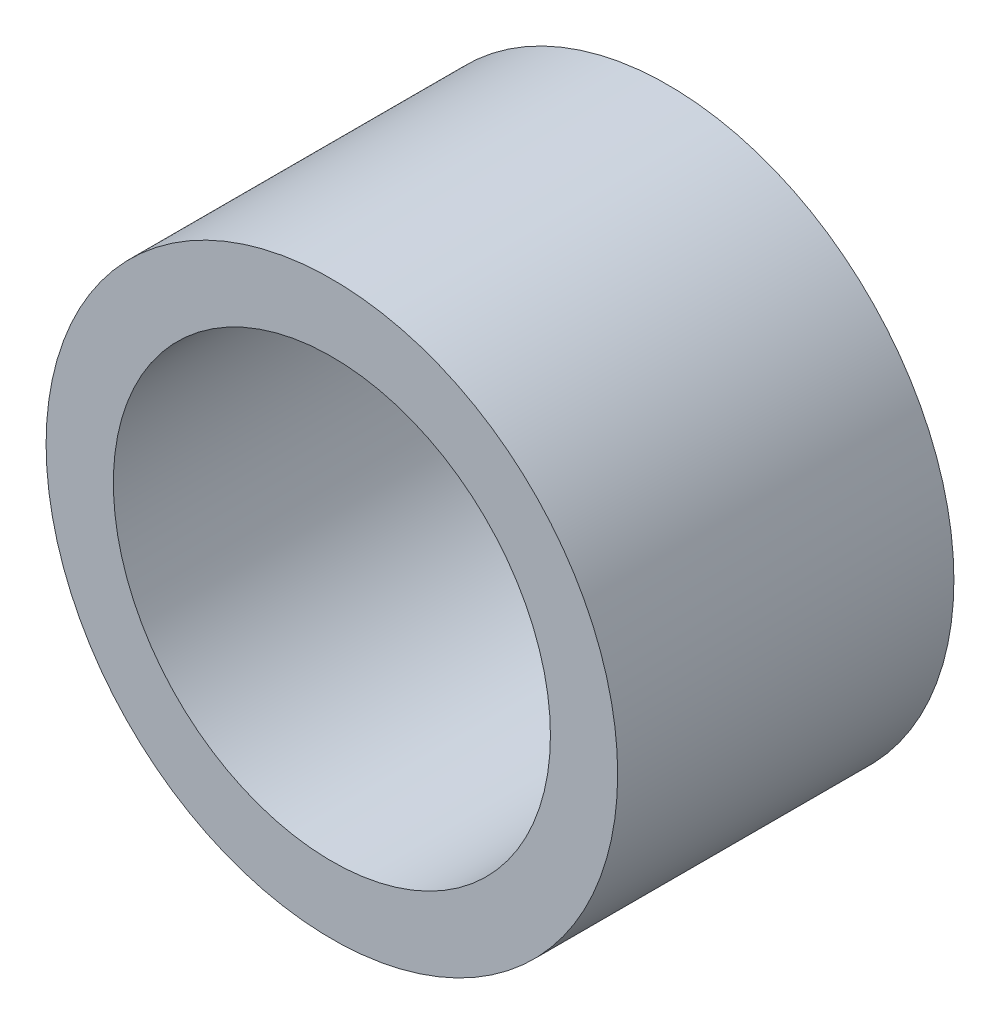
ISO-10303-21;
HEADER;
FILE_DESCRIPTION(('STEP AP214'),'2;1');
FILE_NAME('part.step','',(''),(''),'','','');
FILE_SCHEMA(('AUTOMOTIVE_DESIGN { 1 0 10303 214 1 1 1 1 }'));
ENDSEC;
DATA;
#1=APPLICATION_CONTEXT('core data for automotive mechanical design processes');
#2=APPLICATION_PROTOCOL_DEFINITION('international standard','automotive_design',2000,#1);
#3=PRODUCT_CONTEXT('',#1,'mechanical');
#4=PRODUCT('Part','Part','',(#3));
#5=PRODUCT_RELATED_PRODUCT_CATEGORY('part','',(#4));
#6=PRODUCT_DEFINITION_FORMATION('','',#4);
#7=PRODUCT_DEFINITION_CONTEXT('part definition',#1,'design');
#8=PRODUCT_DEFINITION('design','',#6,#7);
#9=PRODUCT_DEFINITION_SHAPE('','',#8);
#10=(LENGTH_UNIT() NAMED_UNIT(*) SI_UNIT(.MILLI.,.METRE.));
#11=(NAMED_UNIT(*) PLANE_ANGLE_UNIT() SI_UNIT($,.RADIAN.));
#12=(NAMED_UNIT(*) SI_UNIT($,.STERADIAN.) SOLID_ANGLE_UNIT());
#13=UNCERTAINTY_MEASURE_WITH_UNIT(LENGTH_MEASURE(1.E-05),#10,'distance_accuracy_value','');
#14=(GEOMETRIC_REPRESENTATION_CONTEXT(3) GLOBAL_UNCERTAINTY_ASSIGNED_CONTEXT((#13)) GLOBAL_UNIT_ASSIGNED_CONTEXT((#10,
#11,#12)) REPRESENTATION_CONTEXT('',''));
#15=CARTESIAN_POINT('',(0.,0.,0.));
#16=DIRECTION('',(0.,0.,1.));
#17=DIRECTION('',(1.,0.,0.));
#18=AXIS2_PLACEMENT_3D('',#15,#16,#17);
#19=CARTESIAN_POINT('',(0.,0.,10.));
#20=DIRECTION('',(0.,0.,1.));
#21=DIRECTION('',(1.,0.,0.));
#22=AXIS2_PLACEMENT_3D('',#19,#20,#21);
#23=PLANE('',#22);
#24=CARTESIAN_POINT('',(0.,0.,10.));
#25=DIRECTION('',(0.,0.,1.));
#26=DIRECTION('',(1.,0.,0.));
#27=AXIS2_PLACEMENT_3D('',#24,#25,#26);
#28=CIRCLE('',#27,8.5);
#29=CARTESIAN_POINT('',(8.5,0.,9.99999999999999));
#30=VERTEX_POINT('',#29);
#31=EDGE_CURVE('E10',#30,#30,#28,.T.);
#32=ORIENTED_EDGE('',*,*,#31,.T.);
#33=EDGE_LOOP('',(#32));
#34=FACE_BOUND('',#33,.T.);
#35=CARTESIAN_POINT('',(0.,0.,10.));
#36=DIRECTION('',(0.,0.,1.));
#37=DIRECTION('',(1.,0.,0.));
#38=AXIS2_PLACEMENT_3D('',#35,#36,#37);
#39=CIRCLE('',#38,6.5);
#40=CARTESIAN_POINT('',(6.5,0.,10.));
#41=VERTEX_POINT('',#40);
#42=EDGE_CURVE('E38',#41,#41,#39,.T.);
#43=ORIENTED_EDGE('',*,*,#42,.F.);
#44=EDGE_LOOP('',(#43));
#45=FACE_BOUND('',#44,.T.);
#46=ADVANCED_FACE('F27',(#34,#45),#23,.T.);
#47=CARTESIAN_POINT('',(0.,-1.66533453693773E-13,0.));
#48=DIRECTION('',(0.,0.,1.));
#49=DIRECTION('',(1.,0.,0.));
#50=AXIS2_PLACEMENT_3D('',#47,#48,#49);
#51=PLANE('',#50);
#52=CARTESIAN_POINT('',(0.,-1.66533453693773E-13,0.));
#53=DIRECTION('',(0.,0.,1.));
#54=DIRECTION('',(1.,0.,0.));
#55=AXIS2_PLACEMENT_3D('',#52,#53,#54);
#56=CIRCLE('',#55,8.5);
#57=CARTESIAN_POINT('',(8.50000000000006,-1.65884667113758E-13,0.));
#58=VERTEX_POINT('',#57);
#59=EDGE_CURVE('E34',#58,#58,#56,.T.);
#60=ORIENTED_EDGE('',*,*,#59,.F.);
#61=EDGE_LOOP('',(#60));
#62=FACE_BOUND('',#61,.T.);
#63=CARTESIAN_POINT('',(0.,-1.66533453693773E-13,0.));
#64=DIRECTION('',(0.,0.,1.));
#65=DIRECTION('',(1.,0.,0.));
#66=AXIS2_PLACEMENT_3D('',#63,#64,#65);
#67=CIRCLE('',#66,6.5);
#68=CARTESIAN_POINT('',(6.50000000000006,-1.66037322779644E-13,0.));
#69=VERTEX_POINT('',#68);
#70=EDGE_CURVE('E42',#69,#69,#67,.T.);
#71=ORIENTED_EDGE('',*,*,#70,.T.);
#72=EDGE_LOOP('',(#71));
#73=FACE_BOUND('',#72,.T.);
#74=ADVANCED_FACE('F48',(#62,#73),#51,.F.);
#75=CARTESIAN_POINT('',(0.,0.,10.));
#76=DIRECTION('',(0.,0.,-1.));
#77=DIRECTION('',(-1.,0.,0.));
#78=AXIS2_PLACEMENT_3D('',#75,#76,#77);
#79=CYLINDRICAL_SURFACE('',#78,8.5);
#80=ORIENTED_EDGE('',*,*,#31,.F.);
#81=EDGE_LOOP('',(#80));
#82=FACE_BOUND('',#81,.T.);
#83=ORIENTED_EDGE('',*,*,#59,.T.);
#84=EDGE_LOOP('',(#83));
#85=FACE_BOUND('',#84,.T.);
#86=ADVANCED_FACE('F29',(#82,#85),#79,.T.);
#87=CARTESIAN_POINT('',(0.,0.,10.));
#88=DIRECTION('',(0.,0.,-1.));
#89=DIRECTION('',(-1.,0.,0.));
#90=AXIS2_PLACEMENT_3D('',#87,#88,#89);
#91=CYLINDRICAL_SURFACE('',#90,6.5);
#92=ORIENTED_EDGE('',*,*,#42,.T.);
#93=EDGE_LOOP('',(#92));
#94=FACE_BOUND('',#93,.T.);
#95=ORIENTED_EDGE('',*,*,#70,.F.);
#96=EDGE_LOOP('',(#95));
#97=FACE_BOUND('',#96,.T.);
#98=ADVANCED_FACE('F50',(#94,#97),#91,.F.);
#99=CLOSED_SHELL('',(#46,#74,#86,#98));
#100=MANIFOLD_SOLID_BREP('B2',#99);
#101=ADVANCED_BREP_SHAPE_REPRESENTATION('',(#18,#100),#14);
#102=SHAPE_DEFINITION_REPRESENTATION(#9,#101);
ENDSEC;
END-ISO-10303-21;
